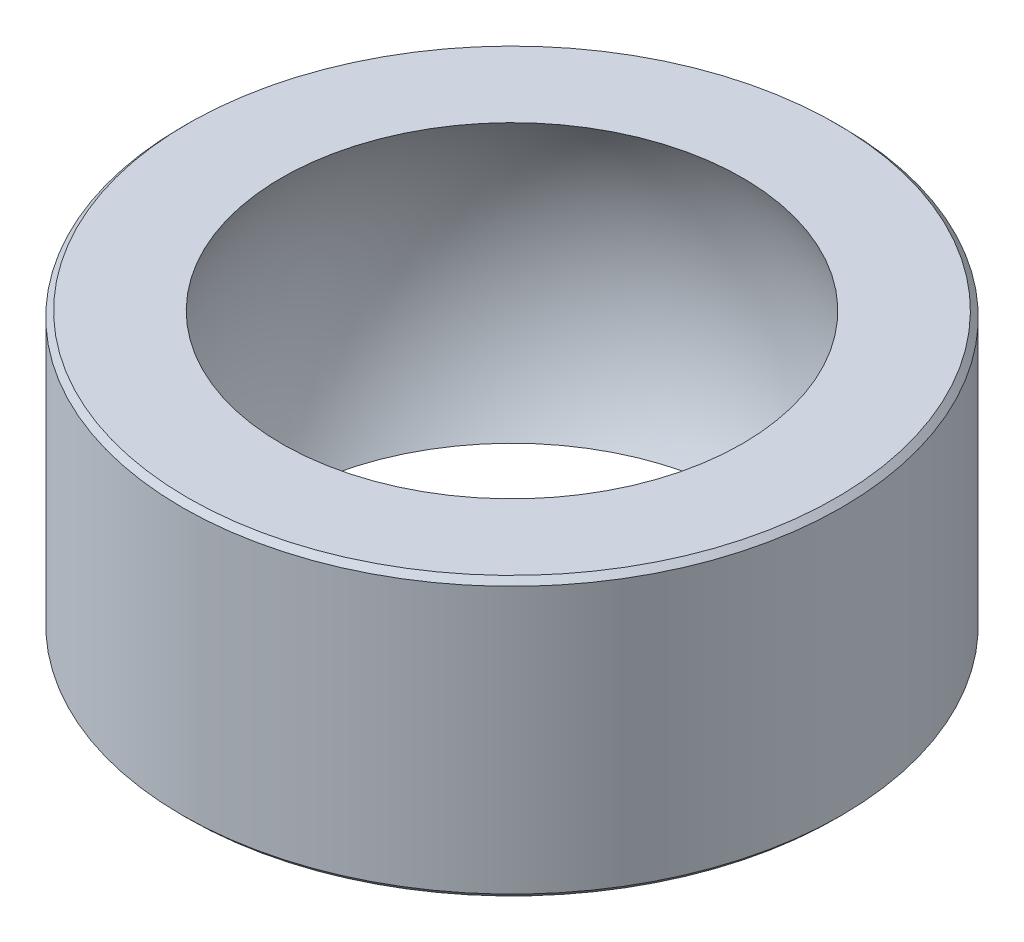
ISO-10303-21;
HEADER;
FILE_DESCRIPTION(('STEP AP214'),'2;1');
FILE_NAME('part.step','',(''),(''),'','','');
FILE_SCHEMA(('AUTOMOTIVE_DESIGN { 1 0 10303 214 1 1 1 1 }'));
ENDSEC;
DATA;
#1=APPLICATION_CONTEXT('core data for automotive mechanical design processes');
#2=APPLICATION_PROTOCOL_DEFINITION('international standard','automotive_design',2000,#1);
#3=PRODUCT_CONTEXT('',#1,'mechanical');
#4=PRODUCT('Part','Part','',(#3));
#5=PRODUCT_RELATED_PRODUCT_CATEGORY('part','',(#4));
#6=PRODUCT_DEFINITION_FORMATION('','',#4);
#7=PRODUCT_DEFINITION_CONTEXT('part definition',#1,'design');
#8=PRODUCT_DEFINITION('design','',#6,#7);
#9=PRODUCT_DEFINITION_SHAPE('','',#8);
#10=(LENGTH_UNIT() NAMED_UNIT(*) SI_UNIT(.MILLI.,.METRE.));
#11=(NAMED_UNIT(*) PLANE_ANGLE_UNIT() SI_UNIT($,.RADIAN.));
#12=(NAMED_UNIT(*) SI_UNIT($,.STERADIAN.) SOLID_ANGLE_UNIT());
#13=UNCERTAINTY_MEASURE_WITH_UNIT(LENGTH_MEASURE(1.E-05),#10,'distance_accuracy_value','');
#14=(GEOMETRIC_REPRESENTATION_CONTEXT(3) GLOBAL_UNCERTAINTY_ASSIGNED_CONTEXT((#13)) GLOBAL_UNIT_ASSIGNED_CONTEXT((#10,
#11,#12)) REPRESENTATION_CONTEXT('',''));
#15=CARTESIAN_POINT('',(0.,0.,0.));
#16=DIRECTION('',(0.,0.,1.));
#17=DIRECTION('',(1.,0.,0.));
#18=AXIS2_PLACEMENT_3D('',#15,#16,#17);
#19=CARTESIAN_POINT('',(0.,0.,0.));
#20=DIRECTION('',(0.,1.,0.));
#21=DIRECTION('',(1.,0.,0.));
#22=AXIS2_PLACEMENT_3D('',#19,#20,#21);
#23=SPHERICAL_SURFACE('',#22,12.303125);
#24=CARTESIAN_POINT('',(0.,-6.35,0.));
#25=DIRECTION('',(0.,1.,0.));
#26=DIRECTION('',(0.,0.,1.));
#27=AXIS2_PLACEMENT_3D('',#24,#25,#26);
#28=CIRCLE('',#27,10.5377599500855);
#29=CARTESIAN_POINT('',(10.5377599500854,-6.35,0.));
#30=VERTEX_POINT('',#29);
#31=EDGE_CURVE('E55',#30,#30,#28,.T.);
#32=CARTESIAN_POINT('',(0.,6.34999999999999,0.));
#33=DIRECTION('',(0.,1.,0.));
#34=DIRECTION('',(0.,0.,1.));
#35=AXIS2_PLACEMENT_3D('',#32,#33,#34);
#36=CIRCLE('',#35,10.5377599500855);
#37=CARTESIAN_POINT('',(10.5377599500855,6.34999999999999,0.));
#38=VERTEX_POINT('',#37);
#39=EDGE_CURVE('E10',#38,#38,#36,.T.);
#40=CARTESIAN_POINT('',(10.5377599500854,-6.35,0.));
#41=CARTESIAN_POINT('',(10.609505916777,-6.23094018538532,0.));
#42=CARTESIAN_POINT('',(10.6792324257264,-6.11066352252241,0.));
#43=CARTESIAN_POINT('',(10.8145701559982,-5.86781675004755,0.));
#44=CARTESIAN_POINT('',(10.8801813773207,-5.74524664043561,0.));
#45=CARTESIAN_POINT('',(11.0072121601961,-5.49795322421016,0.));
#46=CARTESIAN_POINT('',(11.068631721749,-5.37322991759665,0.));
#47=CARTESIAN_POINT('',(11.1872088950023,-5.12177353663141,0.));
#48=CARTESIAN_POINT('',(11.2443665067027,-4.99504046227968,0.));
#49=CARTESIAN_POINT('',(11.3543540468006,-4.73971009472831,0.));
#50=CARTESIAN_POINT('',(11.4071839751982,-4.61111280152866,0.));
#51=CARTESIAN_POINT('',(11.5084554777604,-4.35220173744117,0.));
#52=CARTESIAN_POINT('',(11.5568970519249,-4.22188796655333,0.));
#53=CARTESIAN_POINT('',(11.6493361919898,-3.95969364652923,0.));
#54=CARTESIAN_POINT('',(11.6933337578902,-3.82781309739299,0.));
#55=CARTESIAN_POINT('',(11.776834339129,-3.56263672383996,0.));
#56=CARTESIAN_POINT('',(11.8163373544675,-3.42934089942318,0.));
#57=CARTESIAN_POINT('',(11.8908034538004,-3.16148710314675,0.));
#58=CARTESIAN_POINT('',(11.9257665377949,-3.0269291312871,0.));
#59=CARTESIAN_POINT('',(11.9911126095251,-2.75670561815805,0.));
#60=CARTESIAN_POINT('',(12.0214955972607,-2.62104007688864,0.));
#61=CARTESIAN_POINT('',(12.0776465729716,-2.34875727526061,0.));
#62=CARTESIAN_POINT('',(12.1034145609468,-2.212140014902,0.));
#63=CARTESIAN_POINT('',(12.1503059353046,-1.93811071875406,0.));
#64=CARTESIAN_POINT('',(12.1714293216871,-1.80069868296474,0.));
#65=CARTESIAN_POINT('',(12.2090072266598,-1.52523769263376,0.));
#66=CARTESIAN_POINT('',(12.22546174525,-1.38718873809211,0.));
#67=CARTESIAN_POINT('',(12.253683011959,-1.11061249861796,0.));
#68=CARTESIAN_POINT('',(12.2654497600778,-0.972085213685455,0.));
#69=CARTESIAN_POINT('',(12.284281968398,-0.694711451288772,0.));
#70=CARTESIAN_POINT('',(12.2913474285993,-0.555864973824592,0.));
#71=CARTESIAN_POINT('',(12.3007689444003,-0.278012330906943,0.));
#72=CARTESIAN_POINT('',(12.303125,-0.139006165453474,0.));
#73=CARTESIAN_POINT('',(12.303125,0.139006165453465,0.));
#74=CARTESIAN_POINT('',(12.3007689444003,0.278012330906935,0.));
#75=CARTESIAN_POINT('',(12.2913474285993,0.555864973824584,0.));
#76=CARTESIAN_POINT('',(12.284281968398,0.694711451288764,0.));
#77=CARTESIAN_POINT('',(12.2654497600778,0.972085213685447,0.));
#78=CARTESIAN_POINT('',(12.253683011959,1.11061249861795,0.));
#79=CARTESIAN_POINT('',(12.22546174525,1.3871887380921,0.));
#80=CARTESIAN_POINT('',(12.2090072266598,1.52523769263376,0.));
#81=CARTESIAN_POINT('',(12.1714293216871,1.80069868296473,0.));
#82=CARTESIAN_POINT('',(12.1503059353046,1.93811071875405,0.));
#83=CARTESIAN_POINT('',(12.1034145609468,2.21214001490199,0.));
#84=CARTESIAN_POINT('',(12.0776465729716,2.3487572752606,0.));
#85=CARTESIAN_POINT('',(12.0214955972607,2.62104007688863,0.));
#86=CARTESIAN_POINT('',(11.9911126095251,2.75670561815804,0.));
#87=CARTESIAN_POINT('',(11.9257665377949,3.02692913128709,0.));
#88=CARTESIAN_POINT('',(11.8908034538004,3.16148710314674,0.));
#89=CARTESIAN_POINT('',(11.8163373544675,3.42934089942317,0.));
#90=CARTESIAN_POINT('',(11.776834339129,3.56263672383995,0.));
#91=CARTESIAN_POINT('',(11.6933337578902,3.82781309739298,0.));
#92=CARTESIAN_POINT('',(11.6493361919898,3.95969364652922,0.));
#93=CARTESIAN_POINT('',(11.5568970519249,4.22188796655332,0.));
#94=CARTESIAN_POINT('',(11.5084554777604,4.35220173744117,0.));
#95=CARTESIAN_POINT('',(11.4071839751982,4.61111280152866,0.));
#96=CARTESIAN_POINT('',(11.3543540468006,4.7397100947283,0.));
#97=CARTESIAN_POINT('',(11.2443665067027,4.99504046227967,0.));
#98=CARTESIAN_POINT('',(11.1872088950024,5.1217735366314,0.));
#99=CARTESIAN_POINT('',(11.068631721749,5.37322991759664,0.));
#100=CARTESIAN_POINT('',(11.0072121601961,5.49795322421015,0.));
#101=CARTESIAN_POINT('',(10.8801813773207,5.7452466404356,0.));
#102=CARTESIAN_POINT('',(10.8145701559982,5.86781675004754,0.));
#103=CARTESIAN_POINT('',(10.6792324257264,6.1106635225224,0.));
#104=CARTESIAN_POINT('',(10.609505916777,6.23094018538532,0.));
#105=CARTESIAN_POINT('',(10.5377599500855,6.34999999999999,0.));
#106=B_SPLINE_CURVE_WITH_KNOTS('',3,(#40,#41,#42,#43,#44,#45,#46,#47,#48,#49,#50,#51,#52,#53,
#54,#55,#56,#57,#58,#59,#60,#61,#62,#63,#64,#65,#66,#67,#68,#69,#70,#71,#72,#73,#74,#75,#76,#77,
#78,#79,#80,#81,#82,#83,#84,#85,#86,#87,#88,#89,#90,#91,#92,#93,#94,#95,#96,#97,#98,#99,#100,
#101,#102,#103,#104,#105),.UNSPECIFIED.,.F.,.F.,(4,2,2,2,2,2,2,2,2,2,2,2,2,2,2,2,2,2,2,2,2,2,2,
2,2,2,2,2,2,2,2,2,4),(0.,0.416998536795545,0.83399707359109,1.25099561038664,1.66799414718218,
2.08499268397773,2.50199122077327,2.91898975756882,3.33598829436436,3.75298683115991,
4.16998536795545,4.586983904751,5.00398244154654,5.42098097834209,5.83797951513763,
6.25497805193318,6.67197658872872,7.08897512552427,7.50597366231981,7.92297219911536,
8.3399707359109,8.75696927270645,9.173967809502,9.59096634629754,10.0079648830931,
10.4249634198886,10.8419619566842,11.2589604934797,11.6759590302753,12.0929575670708,
12.5099561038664,12.9269546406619,13.3439531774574),.UNSPECIFIED.);
#107=EDGE_CURVE('BSEAM33',#30,#38,#106,.T.);
#108=ORIENTED_EDGE('',*,*,#31,.F.);
#109=ORIENTED_EDGE('',*,*,#39,.T.);
#110=ORIENTED_EDGE('',*,*,#107,.T.);
#111=ORIENTED_EDGE('',*,*,#107,.F.);
#112=EDGE_LOOP('',(#108,#110,#109,#111));
#113=FACE_BOUND('',#112,.T.);
#114=ADVANCED_FACE('F33',(#113),#23,.F.);
#115=CARTESIAN_POINT('',(10.5377599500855,6.35,0.));
#116=DIRECTION('',(0.,-1.,0.));
#117=DIRECTION('',(0.,0.,-1.));
#118=AXIS2_PLACEMENT_3D('',#115,#116,#117);
#119=PLANE('',#118);
#120=ORIENTED_EDGE('',*,*,#39,.F.);
#121=EDGE_LOOP('',(#120));
#122=FACE_BOUND('',#121,.T.);
#123=CARTESIAN_POINT('',(0.,6.34999999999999,0.));
#124=DIRECTION('',(0.,1.,0.));
#125=DIRECTION('',(0.,0.,1.));
#126=AXIS2_PLACEMENT_3D('',#123,#124,#125);
#127=CIRCLE('',#126,14.82725);
#128=CARTESIAN_POINT('',(0.,6.34999999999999,14.82725));
#129=VERTEX_POINT('',#128);
#130=EDGE_CURVE('E39',#129,#129,#127,.T.);
#131=ORIENTED_EDGE('',*,*,#130,.T.);
#132=EDGE_LOOP('',(#131));
#133=FACE_BOUND('',#132,.T.);
#134=ADVANCED_FACE('F62',(#122,#133),#119,.F.);
#135=CARTESIAN_POINT('',(0.,6.096,0.));
#136=DIRECTION('',(0.,-1.,0.));
#137=DIRECTION('',(0.,0.,-1.));
#138=AXIS2_PLACEMENT_3D('',#135,#136,#137);
#139=CONICAL_SURFACE('',#138,15.08125,0.785398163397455);
#140=ORIENTED_EDGE('',*,*,#130,.F.);
#141=EDGE_LOOP('',(#140));
#142=FACE_BOUND('',#141,.T.);
#143=CARTESIAN_POINT('',(0.,6.096,0.));
#144=DIRECTION('',(0.,1.,0.));
#145=DIRECTION('',(0.,0.,1.));
#146=AXIS2_PLACEMENT_3D('',#143,#144,#145);
#147=CIRCLE('',#146,15.08125);
#148=CARTESIAN_POINT('',(0.,6.096,15.08125));
#149=VERTEX_POINT('',#148);
#150=EDGE_CURVE('E43',#149,#149,#147,.T.);
#151=ORIENTED_EDGE('',*,*,#150,.T.);
#152=EDGE_LOOP('',(#151));
#153=FACE_BOUND('',#152,.T.);
#154=ADVANCED_FACE('F66',(#142,#153),#139,.T.);
#155=CARTESIAN_POINT('',(0.,55.,0.));
#156=DIRECTION('',(0.,1.,0.));
#157=DIRECTION('',(0.,0.,1.));
#158=AXIS2_PLACEMENT_3D('',#155,#156,#157);
#159=CYLINDRICAL_SURFACE('',#158,15.08125);
#160=ORIENTED_EDGE('',*,*,#150,.F.);
#161=EDGE_LOOP('',(#160));
#162=FACE_BOUND('',#161,.T.);
#163=CARTESIAN_POINT('',(0.,-6.096,0.));
#164=DIRECTION('',(0.,1.,0.));
#165=DIRECTION('',(0.,0.,1.));
#166=AXIS2_PLACEMENT_3D('',#163,#164,#165);
#167=CIRCLE('',#166,15.08125);
#168=CARTESIAN_POINT('',(0.,-6.096,15.08125));
#169=VERTEX_POINT('',#168);
#170=EDGE_CURVE('E47',#169,#169,#167,.T.);
#171=ORIENTED_EDGE('',*,*,#170,.T.);
#172=EDGE_LOOP('',(#171));
#173=FACE_BOUND('',#172,.T.);
#174=ADVANCED_FACE('F71',(#162,#173),#159,.T.);
#175=CARTESIAN_POINT('',(0.,-6.35,0.));
#176=DIRECTION('',(0.,1.,0.));
#177=DIRECTION('',(0.,0.,1.));
#178=AXIS2_PLACEMENT_3D('',#175,#176,#177);
#179=CONICAL_SURFACE('',#178,14.82725,0.785398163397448);
#180=ORIENTED_EDGE('',*,*,#170,.F.);
#181=EDGE_LOOP('',(#180));
#182=FACE_BOUND('',#181,.T.);
#183=CARTESIAN_POINT('',(0.,-6.35,0.));
#184=DIRECTION('',(0.,1.,0.));
#185=DIRECTION('',(0.,0.,1.));
#186=AXIS2_PLACEMENT_3D('',#183,#184,#185);
#187=CIRCLE('',#186,14.82725);
#188=CARTESIAN_POINT('',(0.,-6.35,14.82725));
#189=VERTEX_POINT('',#188);
#190=EDGE_CURVE('E52',#189,#189,#187,.T.);
#191=ORIENTED_EDGE('',*,*,#190,.T.);
#192=EDGE_LOOP('',(#191));
#193=FACE_BOUND('',#192,.T.);
#194=ADVANCED_FACE('F77',(#182,#193),#179,.T.);
#195=CARTESIAN_POINT('',(14.82725,-6.35,0.));
#196=DIRECTION('',(0.,1.,0.));
#197=DIRECTION('',(0.,0.,1.));
#198=AXIS2_PLACEMENT_3D('',#195,#196,#197);
#199=PLANE('',#198);
#200=ORIENTED_EDGE('',*,*,#190,.F.);
#201=EDGE_LOOP('',(#200));
#202=FACE_BOUND('',#201,.T.);
#203=ORIENTED_EDGE('',*,*,#31,.T.);
#204=EDGE_LOOP('',(#203));
#205=FACE_BOUND('',#204,.T.);
#206=ADVANCED_FACE('F59',(#202,#205),#199,.F.);
#207=CLOSED_SHELL('',(#114,#134,#154,#174,#194,#206));
#208=MANIFOLD_SOLID_BREP('B2',#207);
#209=ADVANCED_BREP_SHAPE_REPRESENTATION('',(#18,#208),#14);
#210=SHAPE_DEFINITION_REPRESENTATION(#9,#209);
ENDSEC;
END-ISO-10303-21;
